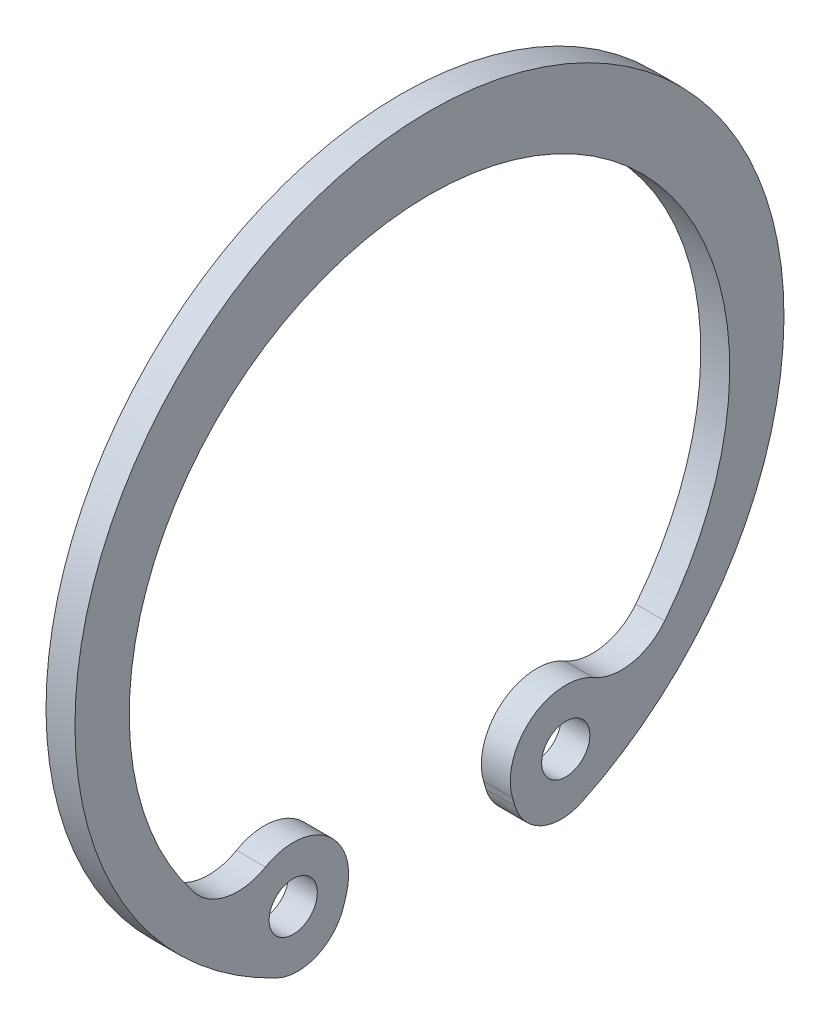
ISO-10303-21;
HEADER;
FILE_DESCRIPTION(('STEP AP214'),'2;1');
FILE_NAME('part.step','',(''),(''),'','','');
FILE_SCHEMA(('AUTOMOTIVE_DESIGN { 1 0 10303 214 1 1 1 1 }'));
ENDSEC;
DATA;
#1=APPLICATION_CONTEXT('core data for automotive mechanical design processes');
#2=APPLICATION_PROTOCOL_DEFINITION('international standard','automotive_design',2000,#1);
#3=PRODUCT_CONTEXT('',#1,'mechanical');
#4=PRODUCT('Part','Part','',(#3));
#5=PRODUCT_RELATED_PRODUCT_CATEGORY('part','',(#4));
#6=PRODUCT_DEFINITION_FORMATION('','',#4);
#7=PRODUCT_DEFINITION_CONTEXT('part definition',#1,'design');
#8=PRODUCT_DEFINITION('design','',#6,#7);
#9=PRODUCT_DEFINITION_SHAPE('','',#8);
#10=(LENGTH_UNIT() NAMED_UNIT(*) SI_UNIT(.MILLI.,.METRE.));
#11=(NAMED_UNIT(*) PLANE_ANGLE_UNIT() SI_UNIT($,.RADIAN.));
#12=(NAMED_UNIT(*) SI_UNIT($,.STERADIAN.) SOLID_ANGLE_UNIT());
#13=UNCERTAINTY_MEASURE_WITH_UNIT(LENGTH_MEASURE(1.E-05),#10,'distance_accuracy_value','');
#14=(GEOMETRIC_REPRESENTATION_CONTEXT(3) GLOBAL_UNCERTAINTY_ASSIGNED_CONTEXT((#13)) GLOBAL_UNIT_ASSIGNED_CONTEXT((#10,
#11,#12)) REPRESENTATION_CONTEXT('',''));
#15=CARTESIAN_POINT('',(0.,0.,0.));
#16=DIRECTION('',(0.,0.,1.));
#17=DIRECTION('',(1.,0.,0.));
#18=AXIS2_PLACEMENT_3D('',#15,#16,#17);
#19=CARTESIAN_POINT('',(-0.6,-11.4649523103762,-5.46304571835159));
#20=DIRECTION('',(1.,0.,0.));
#21=DIRECTION('',(0.,0.,-1.));
#22=AXIS2_PLACEMENT_3D('',#19,#20,#21);
#23=PLANE('',#22);
#24=DIRECTION('',(0.,-0.959229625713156,-0.282627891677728));
#25=VECTOR('',#24,1.);
#26=CARTESIAN_POINT('',(-0.6,-11.68804668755,-3.44377186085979));
#27=LINE('',#26,#25);
#28=CARTESIAN_POINT('',(-0.6,-11.6880466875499,-3.44377186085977));
#29=VERTEX_POINT('',#28);
#30=CARTESIAN_POINT('',(-0.6,-12.0302080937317,-3.5445864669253));
#31=VERTEX_POINT('',#30);
#32=EDGE_CURVE('E94',#29,#31,#27,.T.);
#33=ORIENTED_EDGE('',*,*,#32,.F.);
#34=CARTESIAN_POINT('',(-0.6,-11.0380025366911,-5.65));
#35=DIRECTION('',(1.,0.,0.));
#36=DIRECTION('',(0.,0.,-1.));
#37=AXIS2_PLACEMENT_3D('',#34,#35,#36);
#38=CIRCLE('',#37,2.3);
#39=CARTESIAN_POINT('',(-0.6,-9.04709082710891,-6.80163820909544));
#40=VERTEX_POINT('',#39);
#41=EDGE_CURVE('E124',#40,#29,#38,.T.);
#42=ORIENTED_EDGE('',*,*,#41,.F.);
#43=CARTESIAN_POINT('',(-0.6,-7.05617909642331,-7.95327638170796));
#44=DIRECTION('',(1.,0.,0.));
#45=DIRECTION('',(0.,0.,-1.));
#46=AXIS2_PLACEMENT_3D('',#43,#44,#45);
#47=CIRCLE('',#46,2.3);
#48=CARTESIAN_POINT('',(-0.6,-8.48516549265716,-9.75549664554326));
#49=VERTEX_POINT('',#48);
#50=EDGE_CURVE('E128',#40,#49,#47,.T.);
#51=ORIENTED_EDGE('',*,*,#50,.T.);
#52=CARTESIAN_POINT('',(-0.6,-0.749999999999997,0.));
#53=DIRECTION('',(1.,0.,0.));
#54=DIRECTION('',(0.,0.,-1.));
#55=AXIS2_PLACEMENT_3D('',#52,#53,#54);
#56=CIRCLE('',#55,12.45);
#57=CARTESIAN_POINT('',(-0.6,-8.48516549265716,9.75549664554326));
#58=VERTEX_POINT('',#57);
#59=EDGE_CURVE('E129',#49,#58,#56,.T.);
#60=ORIENTED_EDGE('',*,*,#59,.T.);
#61=CARTESIAN_POINT('',(-0.6,-7.05617909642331,7.95327638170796));
#62=DIRECTION('',(1.,0.,0.));
#63=DIRECTION('',(0.,0.,-1.));
#64=AXIS2_PLACEMENT_3D('',#61,#62,#63);
#65=CIRCLE('',#64,2.3);
#66=CARTESIAN_POINT('',(-0.6,-9.04709082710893,6.80163820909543));
#67=VERTEX_POINT('',#66);
#68=EDGE_CURVE('E133',#58,#67,#65,.T.);
#69=ORIENTED_EDGE('',*,*,#68,.T.);
#70=CARTESIAN_POINT('',(-0.6,-11.0380025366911,5.65));
#71=DIRECTION('',(1.,0.,0.));
#72=DIRECTION('',(0.,0.,-1.));
#73=AXIS2_PLACEMENT_3D('',#70,#71,#72);
#74=CIRCLE('',#73,2.3);
#75=CARTESIAN_POINT('',(-0.6,-11.6880466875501,3.44377186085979));
#76=VERTEX_POINT('',#75);
#77=EDGE_CURVE('E200',#76,#67,#74,.T.);
#78=ORIENTED_EDGE('',*,*,#77,.F.);
#79=DIRECTION('',(0.,-0.959229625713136,0.282627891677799));
#80=VECTOR('',#79,1.);
#81=CARTESIAN_POINT('',(-0.6,-12.0302080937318,3.54458646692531));
#82=LINE('',#81,#80);
#83=CARTESIAN_POINT('',(-0.6,-12.0302080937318,3.54458646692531));
#84=VERTEX_POINT('',#83);
#85=EDGE_CURVE('E168',#76,#84,#82,.T.);
#86=ORIENTED_EDGE('',*,*,#85,.T.);
#87=CARTESIAN_POINT('',(-0.6,-11.4649523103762,5.46304571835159));
#88=DIRECTION('',(1.,0.,0.));
#89=DIRECTION('',(0.,0.,-1.));
#90=AXIS2_PLACEMENT_3D('',#87,#88,#89);
#91=CIRCLE('',#90,2.);
#92=CARTESIAN_POINT('',(-0.6,-13.2704566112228,6.32336787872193));
#93=VERTEX_POINT('',#92);
#94=EDGE_CURVE('E203',#93,#84,#91,.T.);
#95=ORIENTED_EDGE('',*,*,#94,.F.);
#96=CARTESIAN_POINT('',(-0.6,0.,0.));
#97=DIRECTION('',(1.,0.,0.));
#98=DIRECTION('',(0.,0.,-1.));
#99=AXIS2_PLACEMENT_3D('',#96,#97,#98);
#100=CIRCLE('',#99,14.7);
#101=CARTESIAN_POINT('',(-0.6,-13.2704566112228,-6.32336787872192));
#102=VERTEX_POINT('',#101);
#103=EDGE_CURVE('E106',#102,#93,#100,.T.);
#104=ORIENTED_EDGE('',*,*,#103,.F.);
#105=CARTESIAN_POINT('',(-0.6,-11.4649523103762,-5.46304571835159));
#106=DIRECTION('',(1.,0.,0.));
#107=DIRECTION('',(0.,0.,-1.));
#108=AXIS2_PLACEMENT_3D('',#105,#106,#107);
#109=CIRCLE('',#108,2.);
#110=EDGE_CURVE('E103',#31,#102,#109,.T.);
#111=ORIENTED_EDGE('',*,*,#110,.F.);
#112=EDGE_LOOP('',(#33,#42,#51,#60,#69,#78,#86,#95,#104,#111));
#113=FACE_BOUND('',#112,.T.);
#114=CARTESIAN_POINT('',(-0.6,-11.0380025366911,-5.65));
#115=DIRECTION('',(1.,0.,0.));
#116=DIRECTION('',(0.,0.,-1.));
#117=AXIS2_PLACEMENT_3D('',#114,#115,#116);
#118=CIRCLE('',#117,1.);
#119=CARTESIAN_POINT('',(-0.6,-11.0380025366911,-6.65));
#120=VERTEX_POINT('',#119);
#121=EDGE_CURVE('E109',#120,#120,#118,.T.);
#122=ORIENTED_EDGE('',*,*,#121,.T.);
#123=EDGE_LOOP('',(#122));
#124=FACE_BOUND('',#123,.T.);
#125=CARTESIAN_POINT('',(-0.6,-11.0380025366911,5.65));
#126=DIRECTION('',(1.,0.,0.));
#127=DIRECTION('',(0.,0.,-1.));
#128=AXIS2_PLACEMENT_3D('',#125,#126,#127);
#129=CIRCLE('',#128,1.);
#130=CARTESIAN_POINT('',(-0.6,-11.0380025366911,4.65));
#131=VERTEX_POINT('',#130);
#132=EDGE_CURVE('E22',#131,#131,#129,.T.);
#133=ORIENTED_EDGE('',*,*,#132,.T.);
#134=EDGE_LOOP('',(#133));
#135=FACE_BOUND('',#134,.T.);
#136=ADVANCED_FACE('F19',(#113,#124,#135),#23,.F.);
#137=CARTESIAN_POINT('',(0.6,-11.0380025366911,5.65));
#138=DIRECTION('',(1.,0.,0.));
#139=DIRECTION('',(0.,0.,-1.));
#140=AXIS2_PLACEMENT_3D('',#137,#138,#139);
#141=CYLINDRICAL_SURFACE('',#140,1.);
#142=ORIENTED_EDGE('',*,*,#132,.F.);
#143=EDGE_LOOP('',(#142));
#144=FACE_BOUND('',#143,.T.);
#145=CARTESIAN_POINT('',(0.6,-11.0380025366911,5.65));
#146=DIRECTION('',(1.,0.,0.));
#147=DIRECTION('',(0.,0.,-1.));
#148=AXIS2_PLACEMENT_3D('',#145,#146,#147);
#149=CIRCLE('',#148,1.);
#150=CARTESIAN_POINT('',(0.6,-11.0380025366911,4.65));
#151=VERTEX_POINT('',#150);
#152=EDGE_CURVE('E114',#151,#151,#149,.F.);
#153=ORIENTED_EDGE('',*,*,#152,.F.);
#154=EDGE_LOOP('',(#153));
#155=FACE_BOUND('',#154,.T.);
#156=ADVANCED_FACE('F237',(#144,#155),#141,.F.);
#157=CARTESIAN_POINT('',(0.6,-11.0380025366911,-5.65));
#158=DIRECTION('',(1.,0.,0.));
#159=DIRECTION('',(0.,0.,-1.));
#160=AXIS2_PLACEMENT_3D('',#157,#158,#159);
#161=CYLINDRICAL_SURFACE('',#160,1.);
#162=ORIENTED_EDGE('',*,*,#121,.F.);
#163=EDGE_LOOP('',(#162));
#164=FACE_BOUND('',#163,.T.);
#165=CARTESIAN_POINT('',(0.6,-11.0380025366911,-5.65));
#166=DIRECTION('',(1.,0.,0.));
#167=DIRECTION('',(0.,0.,-1.));
#168=AXIS2_PLACEMENT_3D('',#165,#166,#167);
#169=CIRCLE('',#168,1.);
#170=CARTESIAN_POINT('',(0.6,-11.0380025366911,-6.65));
#171=VERTEX_POINT('',#170);
#172=EDGE_CURVE('E117',#171,#171,#169,.F.);
#173=ORIENTED_EDGE('',*,*,#172,.F.);
#174=EDGE_LOOP('',(#173));
#175=FACE_BOUND('',#174,.T.);
#176=ADVANCED_FACE('F235',(#164,#175),#161,.F.);
#177=CARTESIAN_POINT('',(0.6,-11.4649523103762,-5.46304571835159));
#178=DIRECTION('',(1.,0.,0.));
#179=DIRECTION('',(0.,0.,-1.));
#180=AXIS2_PLACEMENT_3D('',#177,#178,#179);
#181=CYLINDRICAL_SURFACE('',#180,2.);
#182=CARTESIAN_POINT('',(0.6,-11.4649523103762,-5.46304571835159));
#183=DIRECTION('',(1.,0.,0.));
#184=DIRECTION('',(0.,0.,-1.));
#185=AXIS2_PLACEMENT_3D('',#182,#183,#184);
#186=CIRCLE('',#185,2.);
#187=CARTESIAN_POINT('',(0.6,-12.0302080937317,-3.5445864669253));
#188=VERTEX_POINT('',#187);
#189=CARTESIAN_POINT('',(0.6,-13.2704566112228,-6.32336787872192));
#190=VERTEX_POINT('',#189);
#191=EDGE_CURVE('E113',#188,#190,#186,.T.);
#192=ORIENTED_EDGE('',*,*,#191,.F.);
#193=DIRECTION('',(1.,0.,0.));
#194=VECTOR('',#193,1.);
#195=CARTESIAN_POINT('',(0.6,-12.0302080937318,-3.54458646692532));
#196=LINE('',#195,#194);
#197=EDGE_CURVE('E98',#188,#31,#196,.F.);
#198=ORIENTED_EDGE('',*,*,#197,.T.);
#199=ORIENTED_EDGE('',*,*,#110,.T.);
#200=DIRECTION('',(1.,0.,0.));
#201=VECTOR('',#200,1.);
#202=CARTESIAN_POINT('',(0.6,-13.2704566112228,-6.32336787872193));
#203=LINE('',#202,#201);
#204=EDGE_CURVE('E206',#190,#102,#203,.F.);
#205=ORIENTED_EDGE('',*,*,#204,.F.);
#206=EDGE_LOOP('',(#192,#198,#199,#205));
#207=FACE_BOUND('',#206,.T.);
#208=ADVANCED_FACE('F111',(#207),#181,.T.);
#209=CARTESIAN_POINT('',(0.6,0.,0.));
#210=DIRECTION('',(1.,0.,0.));
#211=DIRECTION('',(0.,0.,-1.));
#212=AXIS2_PLACEMENT_3D('',#209,#210,#211);
#213=CYLINDRICAL_SURFACE('',#212,14.7);
#214=CARTESIAN_POINT('',(0.6,0.,0.));
#215=DIRECTION('',(1.,0.,0.));
#216=DIRECTION('',(0.,0.,-1.));
#217=AXIS2_PLACEMENT_3D('',#214,#215,#216);
#218=CIRCLE('',#217,14.7);
#219=CARTESIAN_POINT('',(0.6,-13.2704566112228,6.32336787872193));
#220=VERTEX_POINT('',#219);
#221=EDGE_CURVE('E152',#190,#220,#218,.T.);
#222=ORIENTED_EDGE('',*,*,#221,.F.);
#223=ORIENTED_EDGE('',*,*,#204,.T.);
#224=ORIENTED_EDGE('',*,*,#103,.T.);
#225=DIRECTION('',(1.,0.,0.));
#226=VECTOR('',#225,1.);
#227=CARTESIAN_POINT('',(0.6,-13.2704566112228,6.32336787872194));
#228=LINE('',#227,#226);
#229=EDGE_CURVE('E205',#220,#93,#228,.F.);
#230=ORIENTED_EDGE('',*,*,#229,.F.);
#231=EDGE_LOOP('',(#222,#223,#224,#230));
#232=FACE_BOUND('',#231,.T.);
#233=ADVANCED_FACE('F230',(#232),#213,.T.);
#234=CARTESIAN_POINT('',(0.6,-11.4649523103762,5.46304571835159));
#235=DIRECTION('',(1.,0.,0.));
#236=DIRECTION('',(0.,0.,-1.));
#237=AXIS2_PLACEMENT_3D('',#234,#235,#236);
#238=CYLINDRICAL_SURFACE('',#237,2.);
#239=CARTESIAN_POINT('',(0.6,-11.4649523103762,5.46304571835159));
#240=DIRECTION('',(1.,0.,0.));
#241=DIRECTION('',(0.,0.,-1.));
#242=AXIS2_PLACEMENT_3D('',#239,#240,#241);
#243=CIRCLE('',#242,2.);
#244=CARTESIAN_POINT('',(0.6,-12.0302080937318,3.54458646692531));
#245=VERTEX_POINT('',#244);
#246=EDGE_CURVE('E148',#220,#245,#243,.T.);
#247=ORIENTED_EDGE('',*,*,#246,.F.);
#248=ORIENTED_EDGE('',*,*,#229,.T.);
#249=ORIENTED_EDGE('',*,*,#94,.T.);
#250=DIRECTION('',(1.,0.,0.));
#251=VECTOR('',#250,1.);
#252=CARTESIAN_POINT('',(0.6,-12.0302080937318,3.54458646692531));
#253=LINE('',#252,#251);
#254=EDGE_CURVE('E215',#84,#245,#253,.T.);
#255=ORIENTED_EDGE('',*,*,#254,.T.);
#256=EDGE_LOOP('',(#247,#248,#249,#255));
#257=FACE_BOUND('',#256,.T.);
#258=ADVANCED_FACE('F227',(#257),#238,.T.);
#259=CARTESIAN_POINT('',(0.6,-12.0302080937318,3.54458646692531));
#260=DIRECTION('',(0.,0.282627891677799,0.959229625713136));
#261=DIRECTION('',(0.,-0.959229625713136,0.282627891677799));
#262=AXIS2_PLACEMENT_3D('',#259,#260,#261);
#263=PLANE('',#262);
#264=DIRECTION('',(1.,0.,0.));
#265=VECTOR('',#264,1.);
#266=CARTESIAN_POINT('',(0.6,-11.6880466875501,3.44377186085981));
#267=LINE('',#266,#265);
#268=CARTESIAN_POINT('',(0.6,-11.6880466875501,3.44377186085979));
#269=VERTEX_POINT('',#268);
#270=EDGE_CURVE('E202',#269,#76,#267,.F.);
#271=ORIENTED_EDGE('',*,*,#270,.F.);
#272=DIRECTION('',(0.,0.959229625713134,-0.282627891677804));
#273=VECTOR('',#272,1.);
#274=CARTESIAN_POINT('',(0.6,-12.0302080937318,3.54458646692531));
#275=LINE('',#274,#273);
#276=EDGE_CURVE('E146',#245,#269,#275,.T.);
#277=ORIENTED_EDGE('',*,*,#276,.F.);
#278=ORIENTED_EDGE('',*,*,#254,.F.);
#279=ORIENTED_EDGE('',*,*,#85,.F.);
#280=EDGE_LOOP('',(#271,#277,#278,#279));
#281=FACE_BOUND('',#280,.T.);
#282=ADVANCED_FACE('F223',(#281),#263,.F.);
#283=CARTESIAN_POINT('',(0.6,-11.0380025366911,5.65));
#284=DIRECTION('',(1.,0.,0.));
#285=DIRECTION('',(0.,0.,-1.));
#286=AXIS2_PLACEMENT_3D('',#283,#284,#285);
#287=CYLINDRICAL_SURFACE('',#286,2.3);
#288=CARTESIAN_POINT('',(0.6,-11.0380025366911,5.65));
#289=DIRECTION('',(1.,0.,0.));
#290=DIRECTION('',(0.,0.,-1.));
#291=AXIS2_PLACEMENT_3D('',#288,#289,#290);
#292=CIRCLE('',#291,2.3);
#293=CARTESIAN_POINT('',(0.6,-9.04709082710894,6.80163820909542));
#294=VERTEX_POINT('',#293);
#295=EDGE_CURVE('E141',#269,#294,#292,.T.);
#296=ORIENTED_EDGE('',*,*,#295,.F.);
#297=ORIENTED_EDGE('',*,*,#270,.T.);
#298=ORIENTED_EDGE('',*,*,#77,.T.);
#299=DIRECTION('',(1.,0.,0.));
#300=VECTOR('',#299,1.);
#301=CARTESIAN_POINT('',(0.6,-9.04709083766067,6.80163822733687));
#302=LINE('',#301,#300);
#303=EDGE_CURVE('E134',#67,#294,#302,.T.);
#304=ORIENTED_EDGE('',*,*,#303,.T.);
#305=EDGE_LOOP('',(#296,#297,#298,#304));
#306=FACE_BOUND('',#305,.T.);
#307=ADVANCED_FACE('F218',(#306),#287,.T.);
#308=CARTESIAN_POINT('',(0.6,-7.05617909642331,7.95327638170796));
#309=DIRECTION('',(1.,0.,0.));
#310=DIRECTION('',(0.,0.,-1.));
#311=AXIS2_PLACEMENT_3D('',#308,#309,#310);
#312=CYLINDRICAL_SURFACE('',#311,2.3);
#313=DIRECTION('',(1.,0.,0.));
#314=VECTOR('',#313,1.);
#315=CARTESIAN_POINT('',(0.6,-8.48516549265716,9.75549664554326));
#316=LINE('',#315,#314);
#317=CARTESIAN_POINT('',(0.6,-8.48516549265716,9.75549664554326));
#318=VERTEX_POINT('',#317);
#319=EDGE_CURVE('E130',#58,#318,#316,.T.);
#320=ORIENTED_EDGE('',*,*,#319,.T.);
#321=CARTESIAN_POINT('',(0.6,-7.05617909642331,7.95327638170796));
#322=DIRECTION('',(1.,0.,0.));
#323=DIRECTION('',(0.,0.,-1.));
#324=AXIS2_PLACEMENT_3D('',#321,#322,#323);
#325=CIRCLE('',#324,2.3);
#326=EDGE_CURVE('E145',#294,#318,#325,.F.);
#327=ORIENTED_EDGE('',*,*,#326,.F.);
#328=ORIENTED_EDGE('',*,*,#303,.F.);
#329=ORIENTED_EDGE('',*,*,#68,.F.);
#330=EDGE_LOOP('',(#320,#327,#328,#329));
#331=FACE_BOUND('',#330,.T.);
#332=ADVANCED_FACE('F182',(#331),#312,.F.);
#333=CARTESIAN_POINT('',(0.6,-0.749999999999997,0.));
#334=DIRECTION('',(1.,0.,0.));
#335=DIRECTION('',(0.,0.,-1.));
#336=AXIS2_PLACEMENT_3D('',#333,#334,#335);
#337=CYLINDRICAL_SURFACE('',#336,12.45);
#338=DIRECTION('',(1.,0.,0.));
#339=VECTOR('',#338,1.);
#340=CARTESIAN_POINT('',(0.6,-8.48516549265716,-9.75549664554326));
#341=LINE('',#340,#339);
#342=CARTESIAN_POINT('',(0.6,-8.48516549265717,-9.75549664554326));
#343=VERTEX_POINT('',#342);
#344=EDGE_CURVE('E125',#49,#343,#341,.T.);
#345=ORIENTED_EDGE('',*,*,#344,.T.);
#346=CARTESIAN_POINT('',(0.6,-0.749999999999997,0.));
#347=DIRECTION('',(1.,0.,0.));
#348=DIRECTION('',(0.,0.,-1.));
#349=AXIS2_PLACEMENT_3D('',#346,#347,#348);
#350=CIRCLE('',#349,12.45);
#351=EDGE_CURVE('E170',#318,#343,#350,.F.);
#352=ORIENTED_EDGE('',*,*,#351,.F.);
#353=ORIENTED_EDGE('',*,*,#319,.F.);
#354=ORIENTED_EDGE('',*,*,#59,.F.);
#355=EDGE_LOOP('',(#345,#352,#353,#354));
#356=FACE_BOUND('',#355,.T.);
#357=ADVANCED_FACE('F187',(#356),#337,.F.);
#358=CARTESIAN_POINT('',(0.6,-7.05617909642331,-7.95327638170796));
#359=DIRECTION('',(1.,0.,0.));
#360=DIRECTION('',(0.,0.,-1.));
#361=AXIS2_PLACEMENT_3D('',#358,#359,#360);
#362=CYLINDRICAL_SURFACE('',#361,2.3);
#363=DIRECTION('',(1.,0.,0.));
#364=VECTOR('',#363,1.);
#365=CARTESIAN_POINT('',(0.6,-9.04709083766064,-6.80163822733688));
#366=LINE('',#365,#364);
#367=CARTESIAN_POINT('',(0.6,-9.04709082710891,-6.80163820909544));
#368=VERTEX_POINT('',#367);
#369=EDGE_CURVE('E119',#368,#40,#366,.F.);
#370=ORIENTED_EDGE('',*,*,#369,.F.);
#371=CARTESIAN_POINT('',(0.6,-7.05617909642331,-7.95327638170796));
#372=DIRECTION('',(1.,0.,0.));
#373=DIRECTION('',(0.,0.,-1.));
#374=AXIS2_PLACEMENT_3D('',#371,#372,#373);
#375=CIRCLE('',#374,2.3);
#376=EDGE_CURVE('E167',#343,#368,#375,.F.);
#377=ORIENTED_EDGE('',*,*,#376,.F.);
#378=ORIENTED_EDGE('',*,*,#344,.F.);
#379=ORIENTED_EDGE('',*,*,#50,.F.);
#380=EDGE_LOOP('',(#370,#377,#378,#379));
#381=FACE_BOUND('',#380,.T.);
#382=ADVANCED_FACE('F193',(#381),#362,.F.);
#383=CARTESIAN_POINT('',(0.6,-11.0380025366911,-5.65));
#384=DIRECTION('',(1.,0.,0.));
#385=DIRECTION('',(0.,0.,-1.));
#386=AXIS2_PLACEMENT_3D('',#383,#384,#385);
#387=CYLINDRICAL_SURFACE('',#386,2.3);
#388=CARTESIAN_POINT('',(0.6,-11.0380025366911,-5.65));
#389=DIRECTION('',(1.,0.,0.));
#390=DIRECTION('',(0.,0.,-1.));
#391=AXIS2_PLACEMENT_3D('',#388,#389,#390);
#392=CIRCLE('',#391,2.3);
#393=CARTESIAN_POINT('',(0.6,-11.6880466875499,-3.44377186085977));
#394=VERTEX_POINT('',#393);
#395=EDGE_CURVE('E29',#368,#394,#392,.T.);
#396=ORIENTED_EDGE('',*,*,#395,.F.);
#397=ORIENTED_EDGE('',*,*,#369,.T.);
#398=ORIENTED_EDGE('',*,*,#41,.T.);
#399=DIRECTION('',(1.,0.,0.));
#400=VECTOR('',#399,1.);
#401=CARTESIAN_POINT('',(0.6,-11.68804668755,-3.44377186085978));
#402=LINE('',#401,#400);
#403=EDGE_CURVE('E38',#29,#394,#402,.T.);
#404=ORIENTED_EDGE('',*,*,#403,.T.);
#405=EDGE_LOOP('',(#396,#397,#398,#404));
#406=FACE_BOUND('',#405,.T.);
#407=ADVANCED_FACE('F194',(#406),#387,.T.);
#408=CARTESIAN_POINT('',(0.6,-11.68804668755,-3.44377186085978));
#409=DIRECTION('',(0.,0.282627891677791,-0.959229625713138));
#410=DIRECTION('',(0.,0.959229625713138,0.282627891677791));
#411=AXIS2_PLACEMENT_3D('',#408,#409,#410);
#412=PLANE('',#411);
#413=ORIENTED_EDGE('',*,*,#197,.F.);
#414=DIRECTION('',(0.,-0.959229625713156,-0.282627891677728));
#415=VECTOR('',#414,1.);
#416=CARTESIAN_POINT('',(0.6,-11.68804668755,-3.44377186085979));
#417=LINE('',#416,#415);
#418=EDGE_CURVE('E12',#394,#188,#417,.T.);
#419=ORIENTED_EDGE('',*,*,#418,.F.);
#420=ORIENTED_EDGE('',*,*,#403,.F.);
#421=ORIENTED_EDGE('',*,*,#32,.T.);
#422=EDGE_LOOP('',(#413,#419,#420,#421));
#423=FACE_BOUND('',#422,.T.);
#424=ADVANCED_FACE('F96',(#423),#412,.F.);
#425=CARTESIAN_POINT('',(0.6,-11.4649523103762,-5.46304571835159));
#426=DIRECTION('',(1.,0.,0.));
#427=DIRECTION('',(0.,0.,-1.));
#428=AXIS2_PLACEMENT_3D('',#425,#426,#427);
#429=PLANE('',#428);
#430=ORIENTED_EDGE('',*,*,#395,.T.);
#431=ORIENTED_EDGE('',*,*,#418,.T.);
#432=ORIENTED_EDGE('',*,*,#191,.T.);
#433=ORIENTED_EDGE('',*,*,#221,.T.);
#434=ORIENTED_EDGE('',*,*,#246,.T.);
#435=ORIENTED_EDGE('',*,*,#276,.T.);
#436=ORIENTED_EDGE('',*,*,#295,.T.);
#437=ORIENTED_EDGE('',*,*,#326,.T.);
#438=ORIENTED_EDGE('',*,*,#351,.T.);
#439=ORIENTED_EDGE('',*,*,#376,.T.);
#440=EDGE_LOOP('',(#430,#431,#432,#433,#434,#435,#436,#437,#438,#439));
#441=FACE_BOUND('',#440,.T.);
#442=ORIENTED_EDGE('',*,*,#172,.T.);
#443=EDGE_LOOP('',(#442));
#444=FACE_BOUND('',#443,.T.);
#445=ORIENTED_EDGE('',*,*,#152,.T.);
#446=EDGE_LOOP('',(#445));
#447=FACE_BOUND('',#446,.T.);
#448=ADVANCED_FACE('F176',(#441,#444,#447),#429,.T.);
#449=CLOSED_SHELL('',(#136,#156,#176,#208,#233,#258,#282,#307,#332,#357,#382,#407,#424,#448));
#450=MANIFOLD_SOLID_BREP('B1',#449);
#451=ADVANCED_BREP_SHAPE_REPRESENTATION('',(#18,#450),#14);
#452=SHAPE_DEFINITION_REPRESENTATION(#9,#451);
ENDSEC;
END-ISO-10303-21;
